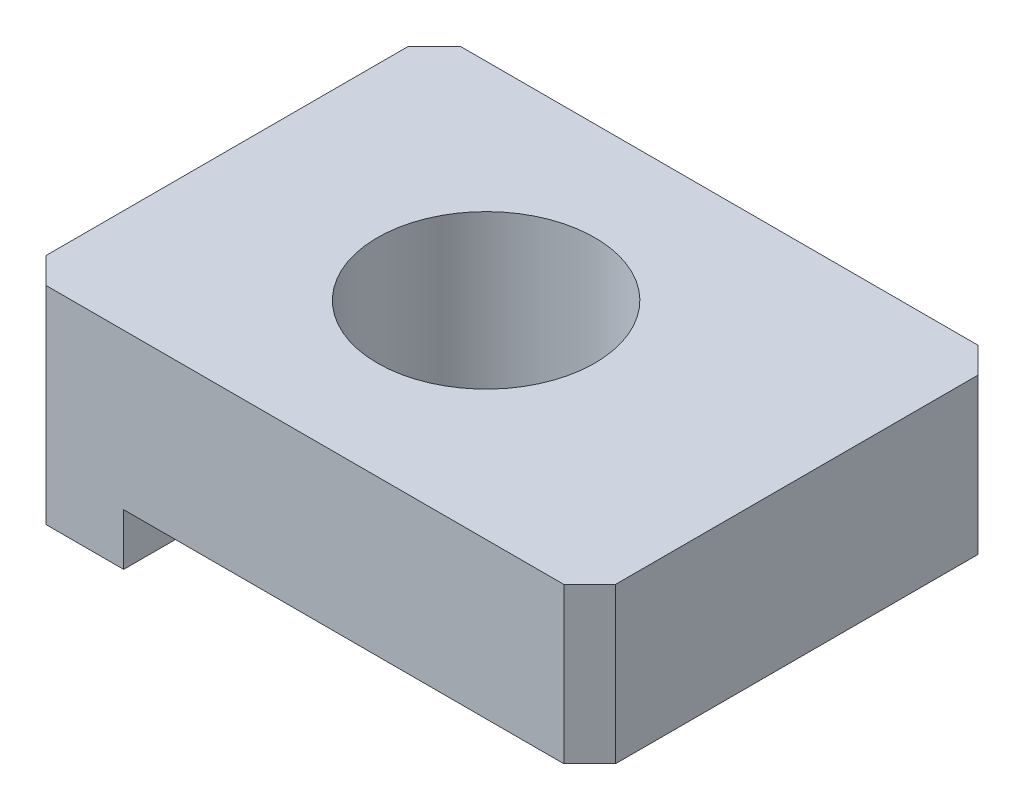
ISO-10303-21;
HEADER;
FILE_DESCRIPTION(('STEP AP214'),'2;1');
FILE_NAME('part.step','',(''),(''),'','','');
FILE_SCHEMA(('AUTOMOTIVE_DESIGN { 1 0 10303 214 1 1 1 1 }'));
ENDSEC;
DATA;
#1=APPLICATION_CONTEXT('core data for automotive mechanical design processes');
#2=APPLICATION_PROTOCOL_DEFINITION('international standard','automotive_design',2000,#1);
#3=PRODUCT_CONTEXT('',#1,'mechanical');
#4=PRODUCT('Part','Part','',(#3));
#5=PRODUCT_RELATED_PRODUCT_CATEGORY('part','',(#4));
#6=PRODUCT_DEFINITION_FORMATION('','',#4);
#7=PRODUCT_DEFINITION_CONTEXT('part definition',#1,'design');
#8=PRODUCT_DEFINITION('design','',#6,#7);
#9=PRODUCT_DEFINITION_SHAPE('','',#8);
#10=(LENGTH_UNIT() NAMED_UNIT(*) SI_UNIT(.MILLI.,.METRE.));
#11=(NAMED_UNIT(*) PLANE_ANGLE_UNIT() SI_UNIT($,.RADIAN.));
#12=(NAMED_UNIT(*) SI_UNIT($,.STERADIAN.) SOLID_ANGLE_UNIT());
#13=UNCERTAINTY_MEASURE_WITH_UNIT(LENGTH_MEASURE(1.E-05),#10,'distance_accuracy_value','');
#14=(GEOMETRIC_REPRESENTATION_CONTEXT(3) GLOBAL_UNCERTAINTY_ASSIGNED_CONTEXT((#13)) GLOBAL_UNIT_ASSIGNED_CONTEXT((#10,
#11,#12)) REPRESENTATION_CONTEXT('',''));
#15=CARTESIAN_POINT('',(0.,0.,0.));
#16=DIRECTION('',(0.,0.,1.));
#17=DIRECTION('',(1.,0.,0.));
#18=AXIS2_PLACEMENT_3D('',#15,#16,#17);
#19=CARTESIAN_POINT('',(0.,4.,-4.));
#20=DIRECTION('',(1.,0.,0.));
#21=DIRECTION('',(0.,0.,-1.));
#22=AXIS2_PLACEMENT_3D('',#19,#20,#21);
#23=PLANE('',#22);
#24=DIRECTION('',(0.,0.,1.));
#25=VECTOR('',#24,1.);
#26=CARTESIAN_POINT('',(0.,0.,-4.));
#27=LINE('',#26,#25);
#28=CARTESIAN_POINT('',(-1.11022302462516E-13,0.,-3.49999999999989));
#29=VERTEX_POINT('',#28);
#30=CARTESIAN_POINT('',(0.,0.,3.49999999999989));
#31=VERTEX_POINT('',#30);
#32=EDGE_CURVE('E153',#29,#31,#27,.T.);
#33=ORIENTED_EDGE('',*,*,#32,.T.);
#34=DIRECTION('',(0.,1.,0.));
#35=VECTOR('',#34,1.);
#36=CARTESIAN_POINT('',(0.,4.,3.49999999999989));
#37=LINE('',#36,#35);
#38=CARTESIAN_POINT('',(0.,4.,3.49999999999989));
#39=VERTEX_POINT('',#38);
#40=EDGE_CURVE('E61',#31,#39,#37,.T.);
#41=ORIENTED_EDGE('',*,*,#40,.T.);
#42=DIRECTION('',(0.,0.,1.));
#43=VECTOR('',#42,1.);
#44=CARTESIAN_POINT('',(0.,4.,-4.));
#45=LINE('',#44,#43);
#46=CARTESIAN_POINT('',(-1.11022302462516E-13,4.,-3.49999999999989));
#47=VERTEX_POINT('',#46);
#48=EDGE_CURVE('E155',#47,#39,#45,.T.);
#49=ORIENTED_EDGE('',*,*,#48,.F.);
#50=DIRECTION('',(0.,-1.,0.));
#51=VECTOR('',#50,1.);
#52=CARTESIAN_POINT('',(-1.11022302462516E-13,4.,-3.49999999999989));
#53=LINE('',#52,#51);
#54=EDGE_CURVE('E187',#47,#29,#53,.T.);
#55=ORIENTED_EDGE('',*,*,#54,.T.);
#56=EDGE_LOOP('',(#33,#41,#49,#55));
#57=FACE_BOUND('',#56,.T.);
#58=ADVANCED_FACE('F53',(#57),#23,.F.);
#59=CARTESIAN_POINT('',(0.,4.,4.));
#60=DIRECTION('',(0.,0.,-1.));
#61=DIRECTION('',(-1.,0.,0.));
#62=AXIS2_PLACEMENT_3D('',#59,#60,#61);
#63=PLANE('',#62);
#64=DIRECTION('',(1.,0.,0.));
#65=VECTOR('',#64,1.);
#66=CARTESIAN_POINT('',(0.,0.,4.));
#67=LINE('',#66,#65);
#68=CARTESIAN_POINT('',(0.499999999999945,0.,3.99999999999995));
#69=VERTEX_POINT('',#68);
#70=CARTESIAN_POINT('',(1.99999999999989,0.,3.99999999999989));
#71=VERTEX_POINT('',#70);
#72=EDGE_CURVE('E145',#69,#71,#67,.T.);
#73=ORIENTED_EDGE('',*,*,#72,.T.);
#74=DIRECTION('',(0.,-1.,0.));
#75=VECTOR('',#74,1.);
#76=CARTESIAN_POINT('',(1.99999999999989,0.,3.99999999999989));
#77=LINE('',#76,#75);
#78=CARTESIAN_POINT('',(1.99999999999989,1.,3.99999999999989));
#79=VERTEX_POINT('',#78);
#80=EDGE_CURVE('E130',#79,#71,#77,.T.);
#81=ORIENTED_EDGE('',*,*,#80,.F.);
#82=DIRECTION('',(-1.,0.,0.));
#83=VECTOR('',#82,1.);
#84=CARTESIAN_POINT('',(1.99999999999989,1.,3.99999999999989));
#85=LINE('',#84,#83);
#86=CARTESIAN_POINT('',(10.5000000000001,1.,4.));
#87=VERTEX_POINT('',#86);
#88=EDGE_CURVE('E139',#87,#79,#85,.T.);
#89=ORIENTED_EDGE('',*,*,#88,.F.);
#90=DIRECTION('',(0.,1.,0.));
#91=VECTOR('',#90,1.);
#92=CARTESIAN_POINT('',(10.5000000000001,4.,4.));
#93=LINE('',#92,#91);
#94=CARTESIAN_POINT('',(10.5000000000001,4.,4.));
#95=VERTEX_POINT('',#94);
#96=EDGE_CURVE('E75',#87,#95,#93,.T.);
#97=ORIENTED_EDGE('',*,*,#96,.T.);
#98=DIRECTION('',(1.,0.,0.));
#99=VECTOR('',#98,1.);
#100=CARTESIAN_POINT('',(0.,4.,4.));
#101=LINE('',#100,#99);
#102=CARTESIAN_POINT('',(0.499999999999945,4.,3.99999999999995));
#103=VERTEX_POINT('',#102);
#104=EDGE_CURVE('E202',#103,#95,#101,.T.);
#105=ORIENTED_EDGE('',*,*,#104,.F.);
#106=DIRECTION('',(0.,-1.,0.));
#107=VECTOR('',#106,1.);
#108=CARTESIAN_POINT('',(0.499999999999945,4.,3.99999999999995));
#109=LINE('',#108,#107);
#110=EDGE_CURVE('E152',#103,#69,#109,.T.);
#111=ORIENTED_EDGE('',*,*,#110,.T.);
#112=EDGE_LOOP('',(#73,#81,#89,#97,#105,#111));
#113=FACE_BOUND('',#112,.T.);
#114=ADVANCED_FACE('F150',(#113),#63,.F.);
#115=CARTESIAN_POINT('',(10.9999999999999,4.,-4.));
#116=DIRECTION('',(-1.,0.,0.));
#117=DIRECTION('',(0.,0.,1.));
#118=AXIS2_PLACEMENT_3D('',#115,#116,#117);
#119=PLANE('',#118);
#120=DIRECTION('',(0.,-1.,0.));
#121=VECTOR('',#120,1.);
#122=CARTESIAN_POINT('',(11.0000000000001,4.,3.5));
#123=LINE('',#122,#121);
#124=CARTESIAN_POINT('',(11.0000000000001,4.,3.5));
#125=VERTEX_POINT('',#124);
#126=CARTESIAN_POINT('',(11.0000000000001,1.,3.5));
#127=VERTEX_POINT('',#126);
#128=EDGE_CURVE('E172',#125,#127,#123,.T.);
#129=ORIENTED_EDGE('',*,*,#128,.T.);
#130=DIRECTION('',(0.,0.,-1.));
#131=VECTOR('',#130,1.);
#132=CARTESIAN_POINT('',(10.9999999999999,1.,-4.));
#133=LINE('',#132,#131);
#134=CARTESIAN_POINT('',(11.,1.,-3.50000000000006));
#135=VERTEX_POINT('',#134);
#136=EDGE_CURVE('E67',#127,#135,#133,.T.);
#137=ORIENTED_EDGE('',*,*,#136,.T.);
#138=DIRECTION('',(0.,1.,0.));
#139=VECTOR('',#138,1.);
#140=CARTESIAN_POINT('',(11.,4.,-3.50000000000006));
#141=LINE('',#140,#139);
#142=CARTESIAN_POINT('',(11.,4.,-3.50000000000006));
#143=VERTEX_POINT('',#142);
#144=EDGE_CURVE('E175',#135,#143,#141,.T.);
#145=ORIENTED_EDGE('',*,*,#144,.T.);
#146=DIRECTION('',(0.,0.,-1.));
#147=VECTOR('',#146,1.);
#148=CARTESIAN_POINT('',(10.9999999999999,4.,-4.));
#149=LINE('',#148,#147);
#150=EDGE_CURVE('E213',#125,#143,#149,.T.);
#151=ORIENTED_EDGE('',*,*,#150,.F.);
#152=EDGE_LOOP('',(#129,#137,#145,#151));
#153=FACE_BOUND('',#152,.T.);
#154=ADVANCED_FACE('F238',(#153),#119,.F.);
#155=CARTESIAN_POINT('',(0.,4.,-4.));
#156=DIRECTION('',(0.,0.,1.));
#157=DIRECTION('',(1.,0.,0.));
#158=AXIS2_PLACEMENT_3D('',#155,#156,#157);
#159=PLANE('',#158);
#160=DIRECTION('',(-1.,0.,0.));
#161=VECTOR('',#160,1.);
#162=CARTESIAN_POINT('',(0.,1.,-4.));
#163=LINE('',#162,#161);
#164=CARTESIAN_POINT('',(10.5000000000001,1.,-4.00000000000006));
#165=VERTEX_POINT('',#164);
#166=CARTESIAN_POINT('',(2.,1.,-4.00000000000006));
#167=VERTEX_POINT('',#166);
#168=EDGE_CURVE('E224',#165,#167,#163,.T.);
#169=ORIENTED_EDGE('',*,*,#168,.T.);
#170=DIRECTION('',(0.,-1.,0.));
#171=VECTOR('',#170,1.);
#172=CARTESIAN_POINT('',(2.,4.,-4.00000000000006));
#173=LINE('',#172,#171);
#174=CARTESIAN_POINT('',(2.,0.,-4.00000000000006));
#175=VERTEX_POINT('',#174);
#176=EDGE_CURVE('E219',#167,#175,#173,.T.);
#177=ORIENTED_EDGE('',*,*,#176,.T.);
#178=DIRECTION('',(-1.,0.,0.));
#179=VECTOR('',#178,1.);
#180=CARTESIAN_POINT('',(0.,0.,-4.));
#181=LINE('',#180,#179);
#182=CARTESIAN_POINT('',(0.499999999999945,0.,-3.99999999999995));
#183=VERTEX_POINT('',#182);
#184=EDGE_CURVE('E147',#175,#183,#181,.T.);
#185=ORIENTED_EDGE('',*,*,#184,.T.);
#186=DIRECTION('',(0.,1.,0.));
#187=VECTOR('',#186,1.);
#188=CARTESIAN_POINT('',(0.499999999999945,4.,-3.99999999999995));
#189=LINE('',#188,#187);
#190=CARTESIAN_POINT('',(0.499999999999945,4.,-3.99999999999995));
#191=VERTEX_POINT('',#190);
#192=EDGE_CURVE('E162',#183,#191,#189,.T.);
#193=ORIENTED_EDGE('',*,*,#192,.T.);
#194=DIRECTION('',(-1.,0.,0.));
#195=VECTOR('',#194,1.);
#196=CARTESIAN_POINT('',(0.,4.,-4.));
#197=LINE('',#196,#195);
#198=CARTESIAN_POINT('',(10.5000000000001,4.,-4.00000000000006));
#199=VERTEX_POINT('',#198);
#200=EDGE_CURVE('E165',#199,#191,#197,.T.);
#201=ORIENTED_EDGE('',*,*,#200,.F.);
#202=DIRECTION('',(0.,-1.,0.));
#203=VECTOR('',#202,1.);
#204=CARTESIAN_POINT('',(10.5000000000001,4.,-4.00000000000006));
#205=LINE('',#204,#203);
#206=EDGE_CURVE('E164',#199,#165,#205,.T.);
#207=ORIENTED_EDGE('',*,*,#206,.T.);
#208=EDGE_LOOP('',(#169,#177,#185,#193,#201,#207));
#209=FACE_BOUND('',#208,.T.);
#210=ADVANCED_FACE('F210',(#209),#159,.F.);
#211=CARTESIAN_POINT('',(0.,4.,0.));
#212=DIRECTION('',(0.,1.,0.));
#213=DIRECTION('',(0.,0.,1.));
#214=AXIS2_PLACEMENT_3D('',#211,#212,#213);
#215=PLANE('',#214);
#216=CARTESIAN_POINT('',(5.,4.,0.));
#217=DIRECTION('',(0.,1.,0.));
#218=DIRECTION('',(0.,0.,1.));
#219=AXIS2_PLACEMENT_3D('',#216,#217,#218);
#220=CIRCLE('',#219,2.1);
#221=CARTESIAN_POINT('',(5.,4.,2.1));
#222=VERTEX_POINT('',#221);
#223=EDGE_CURVE('E158',#222,#222,#220,.T.);
#224=ORIENTED_EDGE('',*,*,#223,.F.);
#225=EDGE_LOOP('',(#224));
#226=FACE_BOUND('',#225,.T.);
#227=ORIENTED_EDGE('',*,*,#150,.T.);
#228=DIRECTION('',(0.707106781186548,0.,0.70710678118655));
#229=VECTOR('',#228,1.);
#230=CARTESIAN_POINT('',(7.25000000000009,4.,-7.25000000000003));
#231=LINE('',#230,#229);
#232=EDGE_CURVE('E183',#143,#199,#231,.F.);
#233=ORIENTED_EDGE('',*,*,#232,.T.);
#234=ORIENTED_EDGE('',*,*,#200,.T.);
#235=DIRECTION('',(0.70710678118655,0.,-0.707106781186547));
#236=VECTOR('',#235,1.);
#237=CARTESIAN_POINT('',(-1.75000000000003,4.,-1.75000000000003));
#238=LINE('',#237,#236);
#239=EDGE_CURVE('E177',#191,#47,#238,.F.);
#240=ORIENTED_EDGE('',*,*,#239,.T.);
#241=ORIENTED_EDGE('',*,*,#48,.T.);
#242=DIRECTION('',(-0.707106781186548,0.,-0.70710678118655));
#243=VECTOR('',#242,1.);
#244=CARTESIAN_POINT('',(-1.75000000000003,4.,1.74999999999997));
#245=LINE('',#244,#243);
#246=EDGE_CURVE('E179',#39,#103,#245,.F.);
#247=ORIENTED_EDGE('',*,*,#246,.T.);
#248=ORIENTED_EDGE('',*,*,#104,.T.);
#249=DIRECTION('',(-0.70710678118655,0.,0.707106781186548));
#250=VECTOR('',#249,1.);
#251=CARTESIAN_POINT('',(7.24999999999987,4.,7.25000000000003));
#252=LINE('',#251,#250);
#253=EDGE_CURVE('E181',#95,#125,#252,.F.);
#254=ORIENTED_EDGE('',*,*,#253,.T.);
#255=EDGE_LOOP('',(#227,#233,#234,#240,#241,#247,#248,#254));
#256=FACE_BOUND('',#255,.T.);
#257=ADVANCED_FACE('F199',(#226,#256),#215,.T.);
#258=CARTESIAN_POINT('',(0.,0.,0.));
#259=DIRECTION('',(0.,1.,0.));
#260=DIRECTION('',(0.,0.,1.));
#261=AXIS2_PLACEMENT_3D('',#258,#259,#260);
#262=PLANE('',#261);
#263=ORIENTED_EDGE('',*,*,#184,.F.);
#264=DIRECTION('',(0.,0.,1.));
#265=VECTOR('',#264,1.);
#266=CARTESIAN_POINT('',(2.00000000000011,0.,-6.00000000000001));
#267=LINE('',#266,#265);
#268=EDGE_CURVE('E133',#175,#71,#267,.T.);
#269=ORIENTED_EDGE('',*,*,#268,.T.);
#270=ORIENTED_EDGE('',*,*,#72,.F.);
#271=DIRECTION('',(0.707106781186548,0.,0.70710678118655));
#272=VECTOR('',#271,1.);
#273=CARTESIAN_POINT('',(0.499999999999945,0.,3.99999999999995));
#274=LINE('',#273,#272);
#275=EDGE_CURVE('E170',#69,#31,#274,.F.);
#276=ORIENTED_EDGE('',*,*,#275,.T.);
#277=ORIENTED_EDGE('',*,*,#32,.F.);
#278=DIRECTION('',(-0.70710678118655,0.,0.707106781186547));
#279=VECTOR('',#278,1.);
#280=CARTESIAN_POINT('',(-1.11022302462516E-13,0.,-3.49999999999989));
#281=LINE('',#280,#279);
#282=EDGE_CURVE('E168',#29,#183,#281,.F.);
#283=ORIENTED_EDGE('',*,*,#282,.T.);
#284=EDGE_LOOP('',(#263,#269,#270,#276,#277,#283));
#285=FACE_BOUND('',#284,.T.);
#286=ADVANCED_FACE('F144',(#285),#262,.F.);
#287=CARTESIAN_POINT('',(5.,4.,0.));
#288=DIRECTION('',(0.,1.,0.));
#289=DIRECTION('',(0.,0.,1.));
#290=AXIS2_PLACEMENT_3D('',#287,#288,#289);
#291=CYLINDRICAL_SURFACE('',#290,2.1);
#292=CARTESIAN_POINT('',(5.,1.,0.));
#293=DIRECTION('',(0.,1.,0.));
#294=DIRECTION('',(0.,0.,1.));
#295=AXIS2_PLACEMENT_3D('',#292,#293,#294);
#296=CIRCLE('',#295,2.1);
#297=CARTESIAN_POINT('',(5.,1.,2.1));
#298=VERTEX_POINT('',#297);
#299=EDGE_CURVE('E221',#298,#298,#296,.F.);
#300=ORIENTED_EDGE('',*,*,#299,.T.);
#301=EDGE_LOOP('',(#300));
#302=FACE_BOUND('',#301,.T.);
#303=ORIENTED_EDGE('',*,*,#223,.T.);
#304=EDGE_LOOP('',(#303));
#305=FACE_BOUND('',#304,.T.);
#306=ADVANCED_FACE('F244',(#302,#305),#291,.F.);
#307=CARTESIAN_POINT('',(10.5000000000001,4.,-4.00000000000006));
#308=DIRECTION('',(-0.70710678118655,0.,0.707106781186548));
#309=DIRECTION('',(0.,-1.,0.));
#310=AXIS2_PLACEMENT_3D('',#307,#308,#309);
#311=PLANE('',#310);
#312=DIRECTION('',(-0.707106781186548,0.,-0.70710678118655));
#313=VECTOR('',#312,1.);
#314=CARTESIAN_POINT('',(10.5000000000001,1.,-4.00000000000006));
#315=LINE('',#314,#313);
#316=EDGE_CURVE('E226',#165,#135,#315,.F.);
#317=ORIENTED_EDGE('',*,*,#316,.F.);
#318=ORIENTED_EDGE('',*,*,#206,.F.);
#319=ORIENTED_EDGE('',*,*,#232,.F.);
#320=ORIENTED_EDGE('',*,*,#144,.F.);
#321=EDGE_LOOP('',(#317,#318,#319,#320));
#322=FACE_BOUND('',#321,.T.);
#323=ADVANCED_FACE('F242',(#322),#311,.F.);
#324=CARTESIAN_POINT('',(11.0000000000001,4.,3.5));
#325=DIRECTION('',(-0.707106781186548,0.,-0.70710678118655));
#326=DIRECTION('',(0.,-1.,0.));
#327=AXIS2_PLACEMENT_3D('',#324,#325,#326);
#328=PLANE('',#327);
#329=DIRECTION('',(0.70710678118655,0.,-0.707106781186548));
#330=VECTOR('',#329,1.);
#331=CARTESIAN_POINT('',(11.0000000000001,1.,3.5));
#332=LINE('',#331,#330);
#333=EDGE_CURVE('E13',#127,#87,#332,.F.);
#334=ORIENTED_EDGE('',*,*,#333,.F.);
#335=ORIENTED_EDGE('',*,*,#128,.F.);
#336=ORIENTED_EDGE('',*,*,#253,.F.);
#337=ORIENTED_EDGE('',*,*,#96,.F.);
#338=EDGE_LOOP('',(#334,#335,#336,#337));
#339=FACE_BOUND('',#338,.T.);
#340=ADVANCED_FACE('F234',(#339),#328,.F.);
#341=CARTESIAN_POINT('',(0.499999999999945,4.,3.99999999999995));
#342=DIRECTION('',(0.70710678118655,0.,-0.707106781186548));
#343=DIRECTION('',(0.,-1.,0.));
#344=AXIS2_PLACEMENT_3D('',#341,#342,#343);
#345=PLANE('',#344);
#346=ORIENTED_EDGE('',*,*,#246,.F.);
#347=ORIENTED_EDGE('',*,*,#40,.F.);
#348=ORIENTED_EDGE('',*,*,#275,.F.);
#349=ORIENTED_EDGE('',*,*,#110,.F.);
#350=EDGE_LOOP('',(#346,#347,#348,#349));
#351=FACE_BOUND('',#350,.T.);
#352=ADVANCED_FACE('F204',(#351),#345,.F.);
#353=CARTESIAN_POINT('',(-1.11022302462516E-13,4.,-3.49999999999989));
#354=DIRECTION('',(0.707106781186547,0.,0.70710678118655));
#355=DIRECTION('',(0.,-1.,0.));
#356=AXIS2_PLACEMENT_3D('',#353,#354,#355);
#357=PLANE('',#356);
#358=ORIENTED_EDGE('',*,*,#239,.F.);
#359=ORIENTED_EDGE('',*,*,#192,.F.);
#360=ORIENTED_EDGE('',*,*,#282,.F.);
#361=ORIENTED_EDGE('',*,*,#54,.F.);
#362=EDGE_LOOP('',(#358,#359,#360,#361));
#363=FACE_BOUND('',#362,.T.);
#364=ADVANCED_FACE('F55',(#363),#357,.F.);
#365=CARTESIAN_POINT('',(2.00000000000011,0.,-6.00000000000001));
#366=DIRECTION('',(-1.,0.,0.));
#367=DIRECTION('',(0.,0.,1.));
#368=AXIS2_PLACEMENT_3D('',#365,#366,#367);
#369=PLANE('',#368);
#370=DIRECTION('',(0.,0.,1.));
#371=VECTOR('',#370,1.);
#372=CARTESIAN_POINT('',(2.00000000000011,1.,-6.00000000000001));
#373=LINE('',#372,#371);
#374=EDGE_CURVE('E136',#167,#79,#373,.T.);
#375=ORIENTED_EDGE('',*,*,#374,.T.);
#376=ORIENTED_EDGE('',*,*,#80,.T.);
#377=ORIENTED_EDGE('',*,*,#268,.F.);
#378=ORIENTED_EDGE('',*,*,#176,.F.);
#379=EDGE_LOOP('',(#375,#376,#377,#378));
#380=FACE_BOUND('',#379,.T.);
#381=ADVANCED_FACE('F132',(#380),#369,.F.);
#382=CARTESIAN_POINT('',(2.00000000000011,1.,-6.00000000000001));
#383=DIRECTION('',(0.,1.,0.));
#384=DIRECTION('',(0.,0.,1.));
#385=AXIS2_PLACEMENT_3D('',#382,#383,#384);
#386=PLANE('',#385);
#387=ORIENTED_EDGE('',*,*,#316,.T.);
#388=ORIENTED_EDGE('',*,*,#136,.F.);
#389=ORIENTED_EDGE('',*,*,#333,.T.);
#390=ORIENTED_EDGE('',*,*,#88,.T.);
#391=ORIENTED_EDGE('',*,*,#374,.F.);
#392=ORIENTED_EDGE('',*,*,#168,.F.);
#393=EDGE_LOOP('',(#387,#388,#389,#390,#391,#392));
#394=FACE_BOUND('',#393,.T.);
#395=ORIENTED_EDGE('',*,*,#299,.F.);
#396=EDGE_LOOP('',(#395));
#397=FACE_BOUND('',#396,.T.);
#398=ADVANCED_FACE('F230',(#394,#397),#386,.F.);
#399=CLOSED_SHELL('',(#58,#114,#154,#210,#257,#286,#306,#323,#340,#352,#364,#381,#398));
#400=MANIFOLD_SOLID_BREP('B2',#399);
#401=ADVANCED_BREP_SHAPE_REPRESENTATION('',(#18,#400),#14);
#402=SHAPE_DEFINITION_REPRESENTATION(#9,#401);
ENDSEC;
END-ISO-10303-21;
